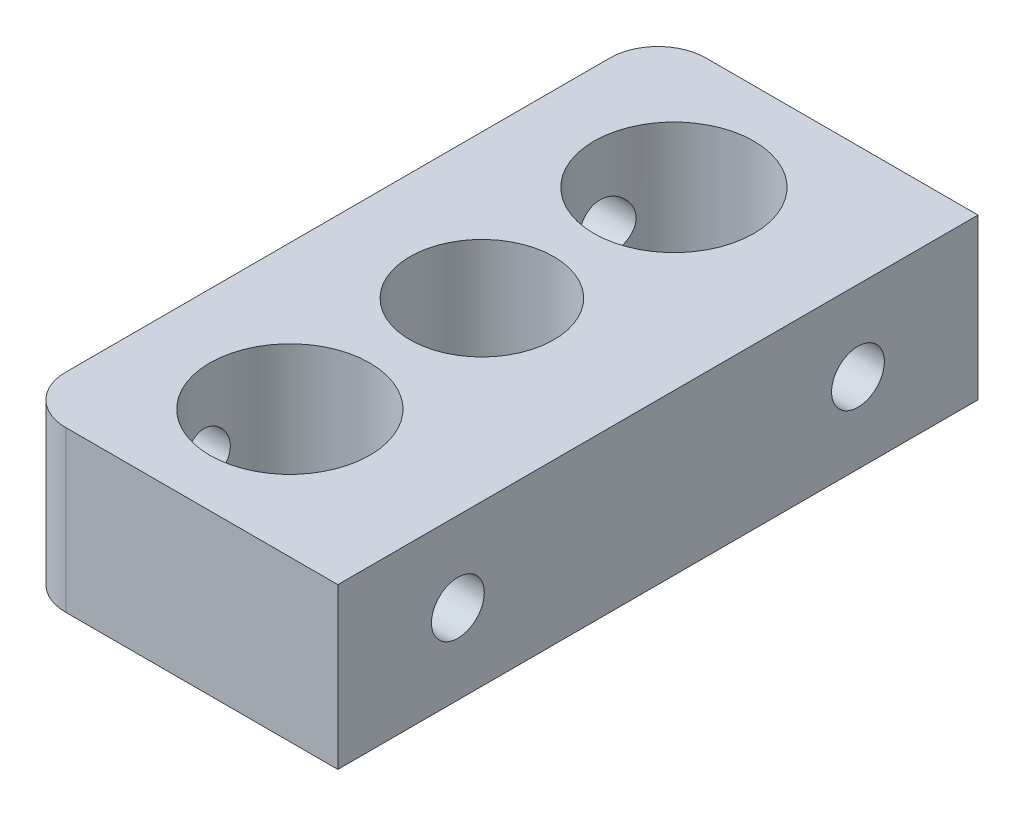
ISO-10303-21;
HEADER;
FILE_DESCRIPTION(('STEP AP214'),'2;1');
FILE_NAME('part.step','',(''),(''),'','','');
FILE_SCHEMA(('AUTOMOTIVE_DESIGN { 1 0 10303 214 1 1 1 1 }'));
ENDSEC;
DATA;
#1=APPLICATION_CONTEXT('core data for automotive mechanical design processes');
#2=APPLICATION_PROTOCOL_DEFINITION('international standard','automotive_design',2000,#1);
#3=PRODUCT_CONTEXT('',#1,'mechanical');
#4=PRODUCT('Part','Part','',(#3));
#5=PRODUCT_RELATED_PRODUCT_CATEGORY('part','',(#4));
#6=PRODUCT_DEFINITION_FORMATION('','',#4);
#7=PRODUCT_DEFINITION_CONTEXT('part definition',#1,'design');
#8=PRODUCT_DEFINITION('design','',#6,#7);
#9=PRODUCT_DEFINITION_SHAPE('','',#8);
#10=(LENGTH_UNIT() NAMED_UNIT(*) SI_UNIT(.MILLI.,.METRE.));
#11=(NAMED_UNIT(*) PLANE_ANGLE_UNIT() SI_UNIT($,.RADIAN.));
#12=(NAMED_UNIT(*) SI_UNIT($,.STERADIAN.) SOLID_ANGLE_UNIT());
#13=UNCERTAINTY_MEASURE_WITH_UNIT(LENGTH_MEASURE(1.E-05),#10,'distance_accuracy_value','');
#14=(GEOMETRIC_REPRESENTATION_CONTEXT(3) GLOBAL_UNCERTAINTY_ASSIGNED_CONTEXT((#13)) GLOBAL_UNIT_ASSIGNED_CONTEXT((#10,
#11,#12)) REPRESENTATION_CONTEXT('',''));
#15=CARTESIAN_POINT('',(0.,0.,0.));
#16=DIRECTION('',(0.,0.,1.));
#17=DIRECTION('',(1.,0.,0.));
#18=AXIS2_PLACEMENT_3D('',#15,#16,#17);
#19=CARTESIAN_POINT('',(-9.,-5.,-40.));
#20=DIRECTION('',(1.,0.,0.));
#21=DIRECTION('',(0.,0.,-1.));
#22=AXIS2_PLACEMENT_3D('',#19,#20,#21);
#23=PLANE('',#22);
#24=CARTESIAN_POINT('',(-9.,0.,-32.5));
#25=DIRECTION('',(1.,0.,0.));
#26=DIRECTION('',(0.,0.,-1.));
#27=AXIS2_PLACEMENT_3D('',#24,#25,#26);
#28=CIRCLE('',#27,1.65);
#29=CARTESIAN_POINT('',(-9.,0.,-34.15));
#30=VERTEX_POINT('',#29);
#31=EDGE_CURVE('E218',#30,#30,#28,.T.);
#32=ORIENTED_EDGE('',*,*,#31,.F.);
#33=EDGE_LOOP('',(#32));
#34=FACE_BOUND('',#33,.T.);
#35=CARTESIAN_POINT('',(-9.,0.,-7.5));
#36=DIRECTION('',(1.,0.,0.));
#37=DIRECTION('',(0.,0.,-1.));
#38=AXIS2_PLACEMENT_3D('',#35,#36,#37);
#39=CIRCLE('',#38,1.65);
#40=CARTESIAN_POINT('',(-9.,0.,-9.15));
#41=VERTEX_POINT('',#40);
#42=EDGE_CURVE('E150',#41,#41,#39,.T.);
#43=ORIENTED_EDGE('',*,*,#42,.F.);
#44=EDGE_LOOP('',(#43));
#45=FACE_BOUND('',#44,.T.);
#46=DIRECTION('',(0.,1.,0.));
#47=VECTOR('',#46,1.);
#48=CARTESIAN_POINT('',(-9.,-5.,0.));
#49=LINE('',#48,#47);
#50=CARTESIAN_POINT('',(-9.,-5.,0.));
#51=VERTEX_POINT('',#50);
#52=CARTESIAN_POINT('',(-9.,5.,0.));
#53=VERTEX_POINT('',#52);
#54=EDGE_CURVE('E97',#51,#53,#49,.T.);
#55=ORIENTED_EDGE('',*,*,#54,.F.);
#56=DIRECTION('',(0.,0.,1.));
#57=VECTOR('',#56,1.);
#58=CARTESIAN_POINT('',(-9.,-5.,-40.));
#59=LINE('',#58,#57);
#60=CARTESIAN_POINT('',(-9.,-5.,-40.));
#61=VERTEX_POINT('',#60);
#62=EDGE_CURVE('E88',#61,#51,#59,.T.);
#63=ORIENTED_EDGE('',*,*,#62,.F.);
#64=DIRECTION('',(0.,1.,0.));
#65=VECTOR('',#64,1.);
#66=CARTESIAN_POINT('',(-9.,-5.,-40.));
#67=LINE('',#66,#65);
#68=CARTESIAN_POINT('',(-9.,5.,-40.));
#69=VERTEX_POINT('',#68);
#70=EDGE_CURVE('E84',#61,#69,#67,.T.);
#71=ORIENTED_EDGE('',*,*,#70,.T.);
#72=DIRECTION('',(0.,0.,1.));
#73=VECTOR('',#72,1.);
#74=CARTESIAN_POINT('',(-9.,5.,-40.));
#75=LINE('',#74,#73);
#76=EDGE_CURVE('E70',#69,#53,#75,.T.);
#77=ORIENTED_EDGE('',*,*,#76,.T.);
#78=EDGE_LOOP('',(#55,#63,#71,#77));
#79=FACE_BOUND('',#78,.T.);
#80=ADVANCED_FACE('F16',(#34,#45,#79),#23,.T.);
#81=CARTESIAN_POINT('',(-9.,-5.,-40.));
#82=DIRECTION('',(0.,-1.,0.));
#83=DIRECTION('',(1.,0.,0.));
#84=AXIS2_PLACEMENT_3D('',#81,#82,#83);
#85=PLANE('',#84);
#86=CARTESIAN_POINT('',(-20.0000000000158,-5.,-19.999999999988));
#87=DIRECTION('',(0.,-1.,0.));
#88=DIRECTION('',(0.,0.,-1.));
#89=AXIS2_PLACEMENT_3D('',#86,#87,#88);
#90=CIRCLE('',#89,4.5);
#91=CARTESIAN_POINT('',(-20.0000000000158,-5.,-24.499999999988));
#92=VERTEX_POINT('',#91);
#93=EDGE_CURVE('E216',#92,#92,#90,.T.);
#94=ORIENTED_EDGE('',*,*,#93,.F.);
#95=EDGE_LOOP('',(#94));
#96=FACE_BOUND('',#95,.T.);
#97=CARTESIAN_POINT('',(-20.,-5.,-8.));
#98=DIRECTION('',(0.,1.,0.));
#99=DIRECTION('',(0.,0.,1.));
#100=AXIS2_PLACEMENT_3D('',#97,#98,#99);
#101=CIRCLE('',#100,5.);
#102=CARTESIAN_POINT('',(-20.,-5.,-3.));
#103=VERTEX_POINT('',#102);
#104=EDGE_CURVE('E233',#103,#103,#101,.T.);
#105=ORIENTED_EDGE('',*,*,#104,.T.);
#106=EDGE_LOOP('',(#105));
#107=FACE_BOUND('',#106,.T.);
#108=CARTESIAN_POINT('',(-20.,-5.,-32.));
#109=DIRECTION('',(0.,1.,0.));
#110=DIRECTION('',(0.,0.,1.));
#111=AXIS2_PLACEMENT_3D('',#108,#109,#110);
#112=CIRCLE('',#111,5.);
#113=CARTESIAN_POINT('',(-20.,-5.,-27.));
#114=VERTEX_POINT('',#113);
#115=EDGE_CURVE('E93',#114,#114,#112,.T.);
#116=ORIENTED_EDGE('',*,*,#115,.T.);
#117=EDGE_LOOP('',(#116));
#118=FACE_BOUND('',#117,.T.);
#119=DIRECTION('',(0.,0.,1.));
#120=VECTOR('',#119,1.);
#121=CARTESIAN_POINT('',(-29.,-5.,-40.));
#122=LINE('',#121,#120);
#123=CARTESIAN_POINT('',(-29.,-5.,-37.));
#124=VERTEX_POINT('',#123);
#125=CARTESIAN_POINT('',(-29.,-5.,-3.));
#126=VERTEX_POINT('',#125);
#127=EDGE_CURVE('E102',#124,#126,#122,.T.);
#128=ORIENTED_EDGE('',*,*,#127,.F.);
#129=CARTESIAN_POINT('',(-26.,-5.,-37.));
#130=DIRECTION('',(0.,-1.,0.));
#131=DIRECTION('',(1.,0.,0.));
#132=AXIS2_PLACEMENT_3D('',#129,#130,#131);
#133=CIRCLE('',#132,3.);
#134=CARTESIAN_POINT('',(-26.,-5.,-40.));
#135=VERTEX_POINT('',#134);
#136=EDGE_CURVE('E193',#124,#135,#133,.T.);
#137=ORIENTED_EDGE('',*,*,#136,.T.);
#138=DIRECTION('',(1.,0.,0.));
#139=VECTOR('',#138,1.);
#140=CARTESIAN_POINT('',(-9.,-5.,-40.));
#141=LINE('',#140,#139);
#142=EDGE_CURVE('E80',#135,#61,#141,.T.);
#143=ORIENTED_EDGE('',*,*,#142,.T.);
#144=ORIENTED_EDGE('',*,*,#62,.T.);
#145=DIRECTION('',(1.,0.,0.));
#146=VECTOR('',#145,1.);
#147=CARTESIAN_POINT('',(-9.,-5.,0.));
#148=LINE('',#147,#146);
#149=CARTESIAN_POINT('',(-26.,-5.,0.));
#150=VERTEX_POINT('',#149);
#151=EDGE_CURVE('E89',#150,#51,#148,.T.);
#152=ORIENTED_EDGE('',*,*,#151,.F.);
#153=CARTESIAN_POINT('',(-26.,-5.,-3.));
#154=DIRECTION('',(0.,-1.,0.));
#155=DIRECTION('',(1.,0.,0.));
#156=AXIS2_PLACEMENT_3D('',#153,#154,#155);
#157=CIRCLE('',#156,3.);
#158=EDGE_CURVE('E195',#150,#126,#157,.T.);
#159=ORIENTED_EDGE('',*,*,#158,.T.);
#160=EDGE_LOOP('',(#128,#137,#143,#144,#152,#159));
#161=FACE_BOUND('',#160,.T.);
#162=ADVANCED_FACE('F164',(#96,#107,#118,#161),#85,.T.);
#163=CARTESIAN_POINT('',(-29.,-5.,-40.));
#164=DIRECTION('',(-1.,0.,0.));
#165=DIRECTION('',(0.,0.,1.));
#166=AXIS2_PLACEMENT_3D('',#163,#164,#165);
#167=PLANE('',#166);
#168=CARTESIAN_POINT('',(-29.,0.,-32.5));
#169=DIRECTION('',(1.,0.,0.));
#170=DIRECTION('',(0.,0.,-1.));
#171=AXIS2_PLACEMENT_3D('',#168,#169,#170);
#172=CIRCLE('',#171,1.65);
#173=CARTESIAN_POINT('',(-29.,0.,-34.15));
#174=VERTEX_POINT('',#173);
#175=EDGE_CURVE('E223',#174,#174,#172,.T.);
#176=ORIENTED_EDGE('',*,*,#175,.T.);
#177=EDGE_LOOP('',(#176));
#178=FACE_BOUND('',#177,.T.);
#179=CARTESIAN_POINT('',(-29.,0.,-7.5));
#180=DIRECTION('',(1.,0.,0.));
#181=DIRECTION('',(0.,0.,-1.));
#182=AXIS2_PLACEMENT_3D('',#179,#180,#181);
#183=CIRCLE('',#182,1.65);
#184=CARTESIAN_POINT('',(-29.,0.,-9.15));
#185=VERTEX_POINT('',#184);
#186=EDGE_CURVE('E115',#185,#185,#183,.T.);
#187=ORIENTED_EDGE('',*,*,#186,.T.);
#188=EDGE_LOOP('',(#187));
#189=FACE_BOUND('',#188,.T.);
#190=DIRECTION('',(0.,0.,1.));
#191=VECTOR('',#190,1.);
#192=CARTESIAN_POINT('',(-29.,5.,-40.));
#193=LINE('',#192,#191);
#194=CARTESIAN_POINT('',(-29.,5.,-37.));
#195=VERTEX_POINT('',#194);
#196=CARTESIAN_POINT('',(-29.,5.,-3.));
#197=VERTEX_POINT('',#196);
#198=EDGE_CURVE('E79',#195,#197,#193,.T.);
#199=ORIENTED_EDGE('',*,*,#198,.F.);
#200=DIRECTION('',(0.,-1.,0.));
#201=VECTOR('',#200,1.);
#202=CARTESIAN_POINT('',(-29.,-5.,-37.));
#203=LINE('',#202,#201);
#204=EDGE_CURVE('E188',#195,#124,#203,.T.);
#205=ORIENTED_EDGE('',*,*,#204,.T.);
#206=ORIENTED_EDGE('',*,*,#127,.T.);
#207=DIRECTION('',(0.,-1.,0.));
#208=VECTOR('',#207,1.);
#209=CARTESIAN_POINT('',(-29.,-5.,-3.));
#210=LINE('',#209,#208);
#211=EDGE_CURVE('E101',#126,#197,#210,.F.);
#212=ORIENTED_EDGE('',*,*,#211,.T.);
#213=EDGE_LOOP('',(#199,#205,#206,#212));
#214=FACE_BOUND('',#213,.T.);
#215=ADVANCED_FACE('F167',(#178,#189,#214),#167,.T.);
#216=CARTESIAN_POINT('',(-9.,5.,-40.));
#217=DIRECTION('',(0.,1.,0.));
#218=DIRECTION('',(-1.,0.,0.));
#219=AXIS2_PLACEMENT_3D('',#216,#217,#218);
#220=PLANE('',#219);
#221=CARTESIAN_POINT('',(-20.0000000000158,5.,-19.999999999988));
#222=DIRECTION('',(0.,-1.,0.));
#223=DIRECTION('',(0.,0.,-1.));
#224=AXIS2_PLACEMENT_3D('',#221,#222,#223);
#225=CIRCLE('',#224,4.5);
#226=CARTESIAN_POINT('',(-20.0000000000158,5.,-24.499999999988));
#227=VERTEX_POINT('',#226);
#228=EDGE_CURVE('E213',#227,#227,#225,.T.);
#229=ORIENTED_EDGE('',*,*,#228,.T.);
#230=EDGE_LOOP('',(#229));
#231=FACE_BOUND('',#230,.T.);
#232=CARTESIAN_POINT('',(-20.,5.,-8.));
#233=DIRECTION('',(0.,1.,0.));
#234=DIRECTION('',(0.,0.,1.));
#235=AXIS2_PLACEMENT_3D('',#232,#233,#234);
#236=CIRCLE('',#235,5.);
#237=CARTESIAN_POINT('',(-20.,5.,-3.));
#238=VERTEX_POINT('',#237);
#239=EDGE_CURVE('E230',#238,#238,#236,.T.);
#240=ORIENTED_EDGE('',*,*,#239,.F.);
#241=EDGE_LOOP('',(#240));
#242=FACE_BOUND('',#241,.T.);
#243=CARTESIAN_POINT('',(-20.,5.,-32.));
#244=DIRECTION('',(0.,1.,0.));
#245=DIRECTION('',(0.,0.,1.));
#246=AXIS2_PLACEMENT_3D('',#243,#244,#245);
#247=CIRCLE('',#246,5.);
#248=CARTESIAN_POINT('',(-20.,5.,-27.));
#249=VERTEX_POINT('',#248);
#250=EDGE_CURVE('E235',#249,#249,#247,.T.);
#251=ORIENTED_EDGE('',*,*,#250,.F.);
#252=EDGE_LOOP('',(#251));
#253=FACE_BOUND('',#252,.T.);
#254=DIRECTION('',(-1.,0.,0.));
#255=VECTOR('',#254,1.);
#256=CARTESIAN_POINT('',(-9.,5.,-40.));
#257=LINE('',#256,#255);
#258=CARTESIAN_POINT('',(-26.,5.,-40.));
#259=VERTEX_POINT('',#258);
#260=EDGE_CURVE('E72',#69,#259,#257,.T.);
#261=ORIENTED_EDGE('',*,*,#260,.T.);
#262=CARTESIAN_POINT('',(-26.,5.,-37.));
#263=DIRECTION('',(0.,1.,0.));
#264=DIRECTION('',(-1.,0.,0.));
#265=AXIS2_PLACEMENT_3D('',#262,#263,#264);
#266=CIRCLE('',#265,3.);
#267=EDGE_CURVE('E24',#259,#195,#266,.T.);
#268=ORIENTED_EDGE('',*,*,#267,.T.);
#269=ORIENTED_EDGE('',*,*,#198,.T.);
#270=CARTESIAN_POINT('',(-26.,5.,-3.));
#271=DIRECTION('',(0.,1.,0.));
#272=DIRECTION('',(-1.,0.,0.));
#273=AXIS2_PLACEMENT_3D('',#270,#271,#272);
#274=CIRCLE('',#273,3.);
#275=CARTESIAN_POINT('',(-26.,5.,0.));
#276=VERTEX_POINT('',#275);
#277=EDGE_CURVE('E31',#197,#276,#274,.T.);
#278=ORIENTED_EDGE('',*,*,#277,.T.);
#279=DIRECTION('',(-1.,0.,0.));
#280=VECTOR('',#279,1.);
#281=CARTESIAN_POINT('',(-9.,5.,0.));
#282=LINE('',#281,#280);
#283=EDGE_CURVE('E74',#53,#276,#282,.T.);
#284=ORIENTED_EDGE('',*,*,#283,.F.);
#285=ORIENTED_EDGE('',*,*,#76,.F.);
#286=EDGE_LOOP('',(#261,#268,#269,#278,#284,#285));
#287=FACE_BOUND('',#286,.T.);
#288=ADVANCED_FACE('F71',(#231,#242,#253,#287),#220,.T.);
#289=CARTESIAN_POINT('',(0.,0.,-40.));
#290=DIRECTION('',(0.,0.,1.));
#291=DIRECTION('',(1.,0.,0.));
#292=AXIS2_PLACEMENT_3D('',#289,#290,#291);
#293=PLANE('',#292);
#294=ORIENTED_EDGE('',*,*,#142,.F.);
#295=DIRECTION('',(0.,-1.,0.));
#296=VECTOR('',#295,1.);
#297=CARTESIAN_POINT('',(-26.,5.,-40.));
#298=LINE('',#297,#296);
#299=EDGE_CURVE('E39',#135,#259,#298,.F.);
#300=ORIENTED_EDGE('',*,*,#299,.T.);
#301=ORIENTED_EDGE('',*,*,#260,.F.);
#302=ORIENTED_EDGE('',*,*,#70,.F.);
#303=EDGE_LOOP('',(#294,#300,#301,#302));
#304=FACE_BOUND('',#303,.T.);
#305=ADVANCED_FACE('F83',(#304),#293,.F.);
#306=CARTESIAN_POINT('',(0.,0.,0.));
#307=DIRECTION('',(0.,0.,1.));
#308=DIRECTION('',(1.,0.,0.));
#309=AXIS2_PLACEMENT_3D('',#306,#307,#308);
#310=PLANE('',#309);
#311=ORIENTED_EDGE('',*,*,#283,.T.);
#312=DIRECTION('',(0.,-1.,0.));
#313=VECTOR('',#312,1.);
#314=CARTESIAN_POINT('',(-26.,0.,0.));
#315=LINE('',#314,#313);
#316=EDGE_CURVE('E11',#276,#150,#315,.T.);
#317=ORIENTED_EDGE('',*,*,#316,.T.);
#318=ORIENTED_EDGE('',*,*,#151,.T.);
#319=ORIENTED_EDGE('',*,*,#54,.T.);
#320=EDGE_LOOP('',(#311,#317,#318,#319));
#321=FACE_BOUND('',#320,.T.);
#322=ADVANCED_FACE('F156',(#321),#310,.T.);
#323=CARTESIAN_POINT('',(-20.,5.,-32.));
#324=DIRECTION('',(0.,1.,0.));
#325=DIRECTION('',(0.,0.,1.));
#326=AXIS2_PLACEMENT_3D('',#323,#324,#325);
#327=CYLINDRICAL_SURFACE('',#326,5.);
#328=CARTESIAN_POINT('',(-24.5141444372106,0.,-34.15));
#329=CARTESIAN_POINT('',(-24.5141439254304,-0.0875265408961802,-34.1500006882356));
#330=CARTESIAN_POINT('',(-24.5174949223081,-0.175049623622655,-34.143007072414));
#331=CARTESIAN_POINT('',(-24.5305012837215,-0.347431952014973,-34.1153687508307));
#332=CARTESIAN_POINT('',(-24.5401584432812,-0.432290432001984,-34.0947201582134));
#333=CARTESIAN_POINT('',(-24.5646747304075,-0.596739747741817,-34.0407378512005));
#334=CARTESIAN_POINT('',(-24.5795177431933,-0.676346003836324,-34.007443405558));
#335=CARTESIAN_POINT('',(-24.6129762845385,-0.828798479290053,-33.9293133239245));
#336=CARTESIAN_POINT('',(-24.6315928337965,-0.901642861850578,-33.8844745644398));
#337=CARTESIAN_POINT('',(-24.6721528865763,-1.04307012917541,-33.7816301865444));
#338=CARTESIAN_POINT('',(-24.6942250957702,-1.11117804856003,-33.7230227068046));
#339=CARTESIAN_POINT('',(-24.7390241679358,-1.23692827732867,-33.5956831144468));
#340=CARTESIAN_POINT('',(-24.7617512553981,-1.29456694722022,-33.526947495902));
#341=CARTESIAN_POINT('',(-24.8075930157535,-1.40143945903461,-33.3760979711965));
#342=CARTESIAN_POINT('',(-24.8306384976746,-1.44989364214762,-33.2934077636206));
#343=CARTESIAN_POINT('',(-24.8737074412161,-1.53198747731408,-33.1202346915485));
#344=CARTESIAN_POINT('',(-24.8937312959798,-1.56562905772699,-33.0297528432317));
#345=CARTESIAN_POINT('',(-24.9288538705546,-1.61616597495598,-32.8455672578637));
#346=CARTESIAN_POINT('',(-24.9440536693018,-1.63342258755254,-32.7519825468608));
#347=CARTESIAN_POINT('',(-24.9691698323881,-1.6515535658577,-32.5625515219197));
#348=CARTESIAN_POINT('',(-24.9790885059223,-1.65243509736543,-32.4667062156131));
#349=CARTESIAN_POINT('',(-24.9928724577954,-1.63796061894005,-32.2816425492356));
#350=CARTESIAN_POINT('',(-24.9970650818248,-1.62357518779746,-32.192371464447));
#351=CARTESIAN_POINT('',(-25.0007366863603,-1.58038674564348,-32.0172944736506));
#352=CARTESIAN_POINT('',(-25.0002160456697,-1.55158489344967,-31.931488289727));
#353=CARTESIAN_POINT('',(-24.9952463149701,-1.48104219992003,-31.7672910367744));
#354=CARTESIAN_POINT('',(-24.9908658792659,-1.43953571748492,-31.688796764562));
#355=CARTESIAN_POINT('',(-24.9793217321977,-1.34460702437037,-31.5396081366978));
#356=CARTESIAN_POINT('',(-24.9721575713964,-1.29118289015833,-31.4689150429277));
#357=CARTESIAN_POINT('',(-24.9560578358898,-1.17201775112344,-31.3350316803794));
#358=CARTESIAN_POINT('',(-24.9470744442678,-1.10594770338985,-31.2721400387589));
#359=CARTESIAN_POINT('',(-24.9289464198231,-0.964372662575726,-31.1580791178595));
#360=CARTESIAN_POINT('',(-24.9198017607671,-0.888866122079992,-31.1069117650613));
#361=CARTESIAN_POINT('',(-24.9025496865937,-0.728386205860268,-31.0165452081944));
#362=CARTESIAN_POINT('',(-24.8944733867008,-0.643225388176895,-30.9776720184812));
#363=CARTESIAN_POINT('',(-24.8809264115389,-0.467378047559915,-30.9148273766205));
#364=CARTESIAN_POINT('',(-24.875455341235,-0.376692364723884,-30.8908536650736));
#365=CARTESIAN_POINT('',(-24.868061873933,-0.193851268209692,-30.8588414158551));
#366=CARTESIAN_POINT('',(-24.8660859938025,-0.101740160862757,-30.8505625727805));
#367=CARTESIAN_POINT('',(-24.8658334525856,0.0825707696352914,-30.8494931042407));
#368=CARTESIAN_POINT('',(-24.8675564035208,0.174770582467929,-30.8567008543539));
#369=CARTESIAN_POINT('',(-24.8743593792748,0.354823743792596,-30.8860713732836));
#370=CARTESIAN_POINT('',(-24.8793754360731,0.442726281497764,-30.9079493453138));
#371=CARTESIAN_POINT('',(-24.8919391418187,0.613619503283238,-30.9656895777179));
#372=CARTESIAN_POINT('',(-24.8994871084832,0.696609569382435,-31.001553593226));
#373=CARTESIAN_POINT('',(-24.9161181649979,0.856798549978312,-31.0869304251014));
#374=CARTESIAN_POINT('',(-24.9252238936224,0.933883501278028,-31.1366525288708));
#375=CARTESIAN_POINT('',(-24.9434727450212,1.07877663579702,-31.2481612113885));
#376=CARTESIAN_POINT('',(-24.9526158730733,1.14658345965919,-31.3099495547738));
#377=CARTESIAN_POINT('',(-24.9696116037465,1.27232109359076,-31.4453001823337));
#378=CARTESIAN_POINT('',(-24.9774361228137,1.3300377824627,-31.5190653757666));
#379=CARTESIAN_POINT('',(-24.9900728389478,1.43226483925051,-31.6754750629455));
#380=CARTESIAN_POINT('',(-24.9948855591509,1.47677749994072,-31.7581180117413));
#381=CARTESIAN_POINT('',(-25.0001910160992,1.55043720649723,-31.9281183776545));
#382=CARTESIAN_POINT('',(-25.0007701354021,1.57988003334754,-32.0153447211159));
#383=CARTESIAN_POINT('',(-24.9970515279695,1.62384720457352,-32.1933703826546));
#384=CARTESIAN_POINT('',(-24.9927549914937,1.63837518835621,-32.2841688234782));
#385=CARTESIAN_POINT('',(-24.9792536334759,1.65196712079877,-32.4635293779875));
#386=CARTESIAN_POINT('',(-24.970214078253,1.65152168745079,-32.5520674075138));
#387=CARTESIAN_POINT('',(-24.9476018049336,1.63662698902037,-32.7273575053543));
#388=CARTESIAN_POINT('',(-24.9340288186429,1.62217689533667,-32.8141094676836));
#389=CARTESIAN_POINT('',(-24.9028746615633,1.57970931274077,-32.9845931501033));
#390=CARTESIAN_POINT('',(-24.8852473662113,1.55153116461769,-33.0682761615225));
#391=CARTESIAN_POINT('',(-24.8471683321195,1.48254238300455,-33.2295673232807));
#392=CARTESIAN_POINT('',(-24.8267157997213,1.4417281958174,-33.3071737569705));
#393=CARTESIAN_POINT('',(-24.7831100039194,1.34591281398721,-33.4589187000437));
#394=CARTESIAN_POINT('',(-24.7598691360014,1.29023259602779,-33.5326035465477));
#395=CARTESIAN_POINT('',(-24.713515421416,1.16734671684,-33.6697370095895));
#396=CARTESIAN_POINT('',(-24.6904026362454,1.10013594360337,-33.7331810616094));
#397=CARTESIAN_POINT('',(-24.6454388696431,0.952937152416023,-33.8504021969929));
#398=CARTESIAN_POINT('',(-24.6236668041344,0.872566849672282,-33.9037319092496));
#399=CARTESIAN_POINT('',(-24.5846381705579,0.702914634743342,-33.9958987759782));
#400=CARTESIAN_POINT('',(-24.5673786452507,0.61363861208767,-34.0347454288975));
#401=CARTESIAN_POINT('',(-24.5408328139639,0.437848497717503,-34.0932678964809));
#402=CARTESIAN_POINT('',(-24.5309272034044,0.351933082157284,-34.1144586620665));
#403=CARTESIAN_POINT('',(-24.5175850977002,0.177342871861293,-34.1428204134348));
#404=CARTESIAN_POINT('',(-24.5141449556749,0.0886696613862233,-34.1499993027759));
#405=CARTESIAN_POINT('',(-24.5141444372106,0.,-34.15));
#406=B_SPLINE_CURVE_WITH_KNOTS('',3,(#328,#329,#330,#331,#332,#333,#334,#335,#336,#337,#338,
#339,#340,#341,#342,#343,#344,#345,#346,#347,#348,#349,#350,#351,#352,#353,#354,#355,#356,#357,
#358,#359,#360,#361,#362,#363,#364,#365,#366,#367,#368,#369,#370,#371,#372,#373,#374,#375,#376,
#377,#378,#379,#380,#381,#382,#383,#384,#385,#386,#387,#388,#389,#390,#391,#392,#393,#394,#395,
#396,#397,#398,#399,#400,#401,#402,#403,#404,#405),.UNSPECIFIED.,.T.,.F.,(4,2,2,2,2,2,2,2,2,2,2,
2,2,2,2,2,2,2,2,2,2,2,2,2,2,2,2,2,2,2,2,2,2,2,2,2,2,2,4),(0.,0.262241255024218,
0.524557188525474,0.786065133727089,1.04764390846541,1.32403647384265,1.60052494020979,
1.89480772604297,2.18905218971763,2.47664685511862,2.76411566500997,3.03434525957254,
3.30455313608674,3.57004969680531,3.83558914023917,4.10931789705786,4.38309159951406,
4.66361210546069,4.94409006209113,5.22023778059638,5.49635653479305,5.76726440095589,
6.0382062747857,6.31348512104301,6.58880425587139,6.86939860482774,7.14994420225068,
7.42474913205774,7.69948699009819,7.96523185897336,8.23099245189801,8.49994079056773,
8.76896483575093,9.05340714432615,9.33797588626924,9.63312986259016,9.92808992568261,
10.1939061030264,10.4595723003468),.UNSPECIFIED.);
#407=CARTESIAN_POINT('',(-24.5141444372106,0.,-34.15));
#408=VERTEX_POINT('',#407);
#409=EDGE_CURVE('E144',#408,#408,#406,.T.);
#410=ORIENTED_EDGE('',*,*,#409,.T.);
#411=EDGE_LOOP('',(#410));
#412=FACE_BOUND('',#411,.T.);
#413=CARTESIAN_POINT('',(-15.4858555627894,0.,-34.15));
#414=CARTESIAN_POINT('',(-15.4858560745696,0.0875265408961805,-34.1500006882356));
#415=CARTESIAN_POINT('',(-15.4825050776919,0.175049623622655,-34.143007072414));
#416=CARTESIAN_POINT('',(-15.4694987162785,0.347431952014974,-34.1153687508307));
#417=CARTESIAN_POINT('',(-15.4598415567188,0.432290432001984,-34.0947201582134));
#418=CARTESIAN_POINT('',(-15.4353252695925,0.59673974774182,-34.0407378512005));
#419=CARTESIAN_POINT('',(-15.4204822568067,0.676346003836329,-34.007443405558));
#420=CARTESIAN_POINT('',(-15.3870237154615,0.828798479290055,-33.9293133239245));
#421=CARTESIAN_POINT('',(-15.3684071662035,0.901642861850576,-33.8844745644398));
#422=CARTESIAN_POINT('',(-15.3278471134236,1.04307012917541,-33.7816301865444));
#423=CARTESIAN_POINT('',(-15.3057749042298,1.11117804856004,-33.7230227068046));
#424=CARTESIAN_POINT('',(-15.2609758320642,1.23692827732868,-33.5956831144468));
#425=CARTESIAN_POINT('',(-15.2382487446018,1.29456694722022,-33.526947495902));
#426=CARTESIAN_POINT('',(-15.1924069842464,1.4014394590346,-33.3760979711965));
#427=CARTESIAN_POINT('',(-15.1693615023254,1.44989364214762,-33.2934077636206));
#428=CARTESIAN_POINT('',(-15.126292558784,1.53198747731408,-33.1202346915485));
#429=CARTESIAN_POINT('',(-15.1062687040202,1.56562905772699,-33.0297528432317));
#430=CARTESIAN_POINT('',(-15.0711461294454,1.61616597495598,-32.8455672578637));
#431=CARTESIAN_POINT('',(-15.0559463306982,1.63342258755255,-32.7519825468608));
#432=CARTESIAN_POINT('',(-15.0308301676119,1.6515535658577,-32.5625515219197));
#433=CARTESIAN_POINT('',(-15.0209114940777,1.65243509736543,-32.4667062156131));
#434=CARTESIAN_POINT('',(-15.0071275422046,1.63796061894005,-32.2816425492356));
#435=CARTESIAN_POINT('',(-15.0029349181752,1.62357518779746,-32.192371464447));
#436=CARTESIAN_POINT('',(-14.9992633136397,1.58038674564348,-32.0172944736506));
#437=CARTESIAN_POINT('',(-14.9997839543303,1.55158489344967,-31.931488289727));
#438=CARTESIAN_POINT('',(-15.0047536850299,1.48104219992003,-31.7672910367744));
#439=CARTESIAN_POINT('',(-15.0091341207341,1.43953571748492,-31.688796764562));
#440=CARTESIAN_POINT('',(-15.0206782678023,1.34460702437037,-31.5396081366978));
#441=CARTESIAN_POINT('',(-15.0278424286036,1.29118289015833,-31.4689150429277));
#442=CARTESIAN_POINT('',(-15.0439421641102,1.17201775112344,-31.3350316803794));
#443=CARTESIAN_POINT('',(-15.0529255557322,1.10594770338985,-31.2721400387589));
#444=CARTESIAN_POINT('',(-15.0710535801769,0.964372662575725,-31.1580791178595));
#445=CARTESIAN_POINT('',(-15.0801982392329,0.888866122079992,-31.1069117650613));
#446=CARTESIAN_POINT('',(-15.0974503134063,0.728386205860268,-31.0165452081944));
#447=CARTESIAN_POINT('',(-15.1055266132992,0.643225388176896,-30.9776720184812));
#448=CARTESIAN_POINT('',(-15.1190735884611,0.467378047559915,-30.9148273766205));
#449=CARTESIAN_POINT('',(-15.124544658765,0.376692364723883,-30.8908536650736));
#450=CARTESIAN_POINT('',(-15.131938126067,0.193851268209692,-30.8588414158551));
#451=CARTESIAN_POINT('',(-15.1339140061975,0.101740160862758,-30.8505625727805));
#452=CARTESIAN_POINT('',(-15.1341665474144,-0.082570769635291,-30.8494931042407));
#453=CARTESIAN_POINT('',(-15.1324435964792,-0.174770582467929,-30.8567008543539));
#454=CARTESIAN_POINT('',(-15.1256406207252,-0.354823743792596,-30.8860713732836));
#455=CARTESIAN_POINT('',(-15.1206245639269,-0.442726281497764,-30.9079493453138));
#456=CARTESIAN_POINT('',(-15.1080608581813,-0.613619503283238,-30.9656895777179));
#457=CARTESIAN_POINT('',(-15.1005128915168,-0.696609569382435,-31.001553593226));
#458=CARTESIAN_POINT('',(-15.0838818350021,-0.856798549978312,-31.0869304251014));
#459=CARTESIAN_POINT('',(-15.0747761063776,-0.933883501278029,-31.1366525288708));
#460=CARTESIAN_POINT('',(-15.0565272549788,-1.07877663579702,-31.2481612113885));
#461=CARTESIAN_POINT('',(-15.0473841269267,-1.14658345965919,-31.3099495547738));
#462=CARTESIAN_POINT('',(-15.0303883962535,-1.27232109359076,-31.4453001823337));
#463=CARTESIAN_POINT('',(-15.0225638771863,-1.3300377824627,-31.5190653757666));
#464=CARTESIAN_POINT('',(-15.0099271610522,-1.43226483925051,-31.6754750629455));
#465=CARTESIAN_POINT('',(-15.0051144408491,-1.47677749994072,-31.7581180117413));
#466=CARTESIAN_POINT('',(-14.9998089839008,-1.55043720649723,-31.9281183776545));
#467=CARTESIAN_POINT('',(-14.9992298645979,-1.57988003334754,-32.0153447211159));
#468=CARTESIAN_POINT('',(-15.0029484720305,-1.62384720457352,-32.1933703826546));
#469=CARTESIAN_POINT('',(-15.0072450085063,-1.63837518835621,-32.2841688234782));
#470=CARTESIAN_POINT('',(-15.0207463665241,-1.65196712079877,-32.4635293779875));
#471=CARTESIAN_POINT('',(-15.0297859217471,-1.65152168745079,-32.5520674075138));
#472=CARTESIAN_POINT('',(-15.0523981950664,-1.63662698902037,-32.7273575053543));
#473=CARTESIAN_POINT('',(-15.065971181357,-1.62217689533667,-32.8141094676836));
#474=CARTESIAN_POINT('',(-15.0971253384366,-1.57970931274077,-32.9845931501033));
#475=CARTESIAN_POINT('',(-15.1147526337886,-1.55153116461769,-33.0682761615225));
#476=CARTESIAN_POINT('',(-15.1528316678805,-1.48254238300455,-33.2295673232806));
#477=CARTESIAN_POINT('',(-15.1732842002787,-1.4417281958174,-33.3071737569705));
#478=CARTESIAN_POINT('',(-15.2168899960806,-1.34591281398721,-33.4589187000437));
#479=CARTESIAN_POINT('',(-15.2401308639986,-1.29023259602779,-33.5326035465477));
#480=CARTESIAN_POINT('',(-15.286484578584,-1.16734671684,-33.6697370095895));
#481=CARTESIAN_POINT('',(-15.3095973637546,-1.10013594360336,-33.7331810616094));
#482=CARTESIAN_POINT('',(-15.3545611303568,-0.95293715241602,-33.8504021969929));
#483=CARTESIAN_POINT('',(-15.3763331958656,-0.872566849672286,-33.9037319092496));
#484=CARTESIAN_POINT('',(-15.4153618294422,-0.702914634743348,-33.9958987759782));
#485=CARTESIAN_POINT('',(-15.4326213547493,-0.613638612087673,-34.0347454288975));
#486=CARTESIAN_POINT('',(-15.4591671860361,-0.437848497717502,-34.0932678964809));
#487=CARTESIAN_POINT('',(-15.4690727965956,-0.351933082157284,-34.1144586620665));
#488=CARTESIAN_POINT('',(-15.4824149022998,-0.177342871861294,-34.1428204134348));
#489=CARTESIAN_POINT('',(-15.4858550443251,-0.0886696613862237,-34.1499993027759));
#490=CARTESIAN_POINT('',(-15.4858555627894,0.,-34.15));
#491=B_SPLINE_CURVE_WITH_KNOTS('',3,(#413,#414,#415,#416,#417,#418,#419,#420,#421,#422,#423,
#424,#425,#426,#427,#428,#429,#430,#431,#432,#433,#434,#435,#436,#437,#438,#439,#440,#441,#442,
#443,#444,#445,#446,#447,#448,#449,#450,#451,#452,#453,#454,#455,#456,#457,#458,#459,#460,#461,
#462,#463,#464,#465,#466,#467,#468,#469,#470,#471,#472,#473,#474,#475,#476,#477,#478,#479,#480,
#481,#482,#483,#484,#485,#486,#487,#488,#489,#490),.UNSPECIFIED.,.T.,.F.,(4,2,2,2,2,2,2,2,2,2,2,
2,2,2,2,2,2,2,2,2,2,2,2,2,2,2,2,2,2,2,2,2,2,2,2,2,2,2,4),(0.,0.262241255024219,
0.524557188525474,0.786065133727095,1.04764390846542,1.32403647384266,1.6005249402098,
1.89480772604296,2.18905218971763,2.47664685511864,2.76411566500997,3.03434525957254,
3.30455313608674,3.5700496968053,3.83558914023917,4.10931789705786,4.38309159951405,
4.66361210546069,4.94409006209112,5.22023778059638,5.49635653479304,5.76726440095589,
6.0382062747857,6.31348512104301,6.58880425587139,6.86939860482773,7.14994420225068,
7.42474913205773,7.69948699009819,7.96523185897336,8.230992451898,8.49994079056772,
8.76896483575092,9.05340714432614,9.33797588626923,9.63312986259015,9.92808992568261,
10.1939061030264,10.4595723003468),.UNSPECIFIED.);
#492=CARTESIAN_POINT('',(-15.4858555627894,0.,-34.15));
#493=VERTEX_POINT('',#492);
#494=EDGE_CURVE('E139',#493,#493,#491,.T.);
#495=ORIENTED_EDGE('',*,*,#494,.T.);
#496=EDGE_LOOP('',(#495));
#497=FACE_BOUND('',#496,.T.);
#498=ORIENTED_EDGE('',*,*,#115,.F.);
#499=EDGE_LOOP('',(#498));
#500=FACE_BOUND('',#499,.T.);
#501=ORIENTED_EDGE('',*,*,#250,.T.);
#502=EDGE_LOOP('',(#501));
#503=FACE_BOUND('',#502,.T.);
#504=ADVANCED_FACE('F152',(#412,#497,#500,#503),#327,.F.);
#505=CARTESIAN_POINT('',(-20.,5.,-8.));
#506=DIRECTION('',(0.,1.,0.));
#507=DIRECTION('',(0.,0.,1.));
#508=AXIS2_PLACEMENT_3D('',#505,#506,#507);
#509=CYLINDRICAL_SURFACE('',#508,5.);
#510=CARTESIAN_POINT('',(-24.8659531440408,0.,-9.15));
#511=CARTESIAN_POINT('',(-24.8659531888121,-0.0915771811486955,-9.14999995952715));
#512=CARTESIAN_POINT('',(-24.8677792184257,-0.183154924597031,-9.14235398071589));
#513=CARTESIAN_POINT('',(-24.8747955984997,-0.363654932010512,-9.11202752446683));
#514=CARTESIAN_POINT('',(-24.8799863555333,-0.452576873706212,-9.08934523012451));
#515=CARTESIAN_POINT('',(-24.8929175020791,-0.625180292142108,-9.02969941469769));
#516=CARTESIAN_POINT('',(-24.9006552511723,-0.708867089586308,-8.99275067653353));
#517=CARTESIAN_POINT('',(-24.9174979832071,-0.868904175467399,-8.90563470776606));
#518=CARTESIAN_POINT('',(-24.9266031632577,-0.945253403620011,-8.85546557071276));
#519=CARTESIAN_POINT('',(-24.9449372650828,-1.08990852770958,-8.74224850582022));
#520=CARTESIAN_POINT('',(-24.9541655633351,-1.15805025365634,-8.67899053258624));
#521=CARTESIAN_POINT('',(-24.9710357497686,-1.28285113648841,-8.5418202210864));
#522=CARTESIAN_POINT('',(-24.978677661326,-1.33951046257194,-8.46790803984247));
#523=CARTESIAN_POINT('',(-24.9909084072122,-1.43969598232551,-8.31142091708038));
#524=CARTESIAN_POINT('',(-24.9954974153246,-1.48322292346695,-8.22884646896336));
#525=CARTESIAN_POINT('',(-25.0004037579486,-1.55576835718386,-8.05743965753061));
#526=CARTESIAN_POINT('',(-25.0007223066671,-1.58479097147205,-7.96860908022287));
#527=CARTESIAN_POINT('',(-24.9963785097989,-1.62669264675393,-7.79058998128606));
#528=CARTESIAN_POINT('',(-24.9918882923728,-1.64009601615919,-7.70152041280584));
#529=CARTESIAN_POINT('',(-24.9779807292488,-1.65227241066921,-7.52277881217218));
#530=CARTESIAN_POINT('',(-24.9685638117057,-1.65104670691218,-7.43310683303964));
#531=CARTESIAN_POINT('',(-24.9452730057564,-1.63436996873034,-7.25699205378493));
#532=CARTESIAN_POINT('',(-24.9314630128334,-1.619117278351,-7.17052167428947));
#533=CARTESIAN_POINT('',(-24.9000829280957,-1.57538023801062,-7.00171892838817));
#534=CARTESIAN_POINT('',(-24.8825121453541,-1.54689345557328,-6.91938732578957));
#535=CARTESIAN_POINT('',(-24.8439022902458,-1.47624620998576,-6.75749548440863));
#536=CARTESIAN_POINT('',(-24.8227510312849,-1.43357567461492,-6.67818504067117));
#537=CARTESIAN_POINT('',(-24.778989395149,-1.33616637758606,-6.52778904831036));
#538=CARTESIAN_POINT('',(-24.7563784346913,-1.2814227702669,-6.45670681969));
#539=CARTESIAN_POINT('',(-24.7100606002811,-1.15765728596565,-6.32047635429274));
#540=CARTESIAN_POINT('',(-24.6863653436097,-1.08799607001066,-6.25590316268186));
#541=CARTESIAN_POINT('',(-24.6413193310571,-0.938138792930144,-6.13933628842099));
#542=CARTESIAN_POINT('',(-24.6199688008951,-0.85794171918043,-6.08734381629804));
#543=CARTESIAN_POINT('',(-24.5819184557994,-0.689388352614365,-5.99790576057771));
#544=CARTESIAN_POINT('',(-24.5651918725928,-0.601083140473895,-5.96037593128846));
#545=CARTESIAN_POINT('',(-24.5382274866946,-0.418418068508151,-5.90105475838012));
#546=CARTESIAN_POINT('',(-24.5279840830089,-0.32406351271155,-5.8792498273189));
#547=CARTESIAN_POINT('',(-24.5158900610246,-0.140663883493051,-5.85362673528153));
#548=CARTESIAN_POINT('',(-24.5133981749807,-0.0518522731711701,-5.8484331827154));
#549=CARTESIAN_POINT('',(-24.5152806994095,0.125366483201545,-5.85238575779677));
#550=CARTESIAN_POINT('',(-24.5196535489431,0.213773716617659,-5.86152862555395));
#551=CARTESIAN_POINT('',(-24.5343440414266,0.3829609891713,-5.89287015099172));
#552=CARTESIAN_POINT('',(-24.5443451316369,0.463899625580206,-5.91437481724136));
#553=CARTESIAN_POINT('',(-24.5690393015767,0.6209663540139,-5.96904599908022));
#554=CARTESIAN_POINT('',(-24.5837334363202,0.69709335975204,-6.00221513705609));
#555=CARTESIAN_POINT('',(-24.6173920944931,0.846865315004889,-6.08124388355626));
#556=CARTESIAN_POINT('',(-24.6365431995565,0.920158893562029,-6.12768808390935));
#557=CARTESIAN_POINT('',(-24.6769766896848,1.05823829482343,-6.23111056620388));
#558=CARTESIAN_POINT('',(-24.6982599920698,1.12302042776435,-6.28809339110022));
#559=CARTESIAN_POINT('',(-24.7432073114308,1.24802255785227,-6.41664863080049));
#560=CARTESIAN_POINT('',(-24.7669187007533,1.30737160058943,-6.48905414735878));
#561=CARTESIAN_POINT('',(-24.8130449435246,1.41316332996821,-6.64314241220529));
#562=CARTESIAN_POINT('',(-24.835459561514,1.45960367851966,-6.72482683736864));
#563=CARTESIAN_POINT('',(-24.8776679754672,1.53888949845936,-6.89711605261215));
#564=CARTESIAN_POINT('',(-24.8974065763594,1.57147184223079,-6.98785625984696));
#565=CARTESIAN_POINT('',(-24.9322868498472,1.62043435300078,-7.1744475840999));
#566=CARTESIAN_POINT('',(-24.9474304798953,1.63682142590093,-7.27029650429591));
#567=CARTESIAN_POINT('',(-24.9714885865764,1.65204845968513,-7.45884874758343));
#568=CARTESIAN_POINT('',(-24.9806955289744,1.6517890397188,-7.55144204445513));
#569=CARTESIAN_POINT('',(-24.9938592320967,1.63570028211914,-7.73563627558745));
#570=CARTESIAN_POINT('',(-24.9978173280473,1.61987490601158,-7.82723745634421));
#571=CARTESIAN_POINT('',(-25.0007359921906,1.57407844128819,-8.00262868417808));
#572=CARTESIAN_POINT('',(-24.9999067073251,1.54475345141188,-8.08658517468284));
#573=CARTESIAN_POINT('',(-24.9944742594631,1.47307367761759,-8.24859998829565));
#574=CARTESIAN_POINT('',(-24.9898708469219,1.43071803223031,-8.32665792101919));
#575=CARTESIAN_POINT('',(-24.9778798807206,1.33354120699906,-8.47580490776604));
#576=CARTESIAN_POINT('',(-24.9704565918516,1.27856377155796,-8.54678909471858));
#577=CARTESIAN_POINT('',(-24.9541505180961,1.15794240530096,-8.67884287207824));
#578=CARTESIAN_POINT('',(-24.9452674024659,1.09229605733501,-8.73991020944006));
#579=CARTESIAN_POINT('',(-24.9271186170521,0.949528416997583,-8.85257171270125));
#580=CARTESIAN_POINT('',(-24.9178504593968,0.872085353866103,-8.90375838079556));
#581=CARTESIAN_POINT('',(-24.9007153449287,0.709601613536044,-8.99249201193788));
#582=CARTESIAN_POINT('',(-24.8928482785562,0.624561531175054,-9.03004004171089));
#583=CARTESIAN_POINT('',(-24.8798784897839,0.450830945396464,-9.08982118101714));
#584=CARTESIAN_POINT('',(-24.8747270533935,0.362237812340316,-9.1123262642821));
#585=CARTESIAN_POINT('',(-24.8677646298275,0.182429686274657,-9.14241448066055));
#586=CARTESIAN_POINT('',(-24.8659530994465,0.0912151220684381,-9.15000004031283));
#587=CARTESIAN_POINT('',(-24.8659531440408,0.,-9.15));
#588=B_SPLINE_CURVE_WITH_KNOTS('',3,(#510,#511,#512,#513,#514,#515,#516,#517,#518,#519,#520,
#521,#522,#523,#524,#525,#526,#527,#528,#529,#530,#531,#532,#533,#534,#535,#536,#537,#538,#539,
#540,#541,#542,#543,#544,#545,#546,#547,#548,#549,#550,#551,#552,#553,#554,#555,#556,#557,#558,
#559,#560,#561,#562,#563,#564,#565,#566,#567,#568,#569,#570,#571,#572,#573,#574,#575,#576,#577,
#578,#579,#580,#581,#582,#583,#584,#585,#586,#587),.UNSPECIFIED.,.T.,.F.,(4,2,2,2,2,2,2,2,2,2,2,
2,2,2,2,2,2,2,2,2,2,2,2,2,2,2,2,2,2,2,2,2,2,2,2,2,2,2,4),(0.,0.274401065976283,
0.548835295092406,0.822985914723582,1.09717608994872,1.37616535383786,1.65515050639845,
1.93411977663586,2.21300972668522,2.48224049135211,2.75144786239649,3.01690616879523,
3.28241328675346,3.55874388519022,3.83518559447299,4.12749966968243,4.41984186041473,
4.71045442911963,5.00081558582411,5.26641352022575,5.53195107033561,5.78386335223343,
6.035832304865,6.3012978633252,6.56687812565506,6.85528953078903,7.14375314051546,
7.43747278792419,7.73106713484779,8.00879138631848,8.28644497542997,8.55200606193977,
8.81758470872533,9.0866477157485,9.3557717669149,9.63433725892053,9.9128809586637,
10.186241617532,10.4595578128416),.UNSPECIFIED.);
#589=CARTESIAN_POINT('',(-24.8659531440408,0.,-9.15));
#590=VERTEX_POINT('',#589);
#591=EDGE_CURVE('E114',#590,#590,#588,.T.);
#592=ORIENTED_EDGE('',*,*,#591,.T.);
#593=EDGE_LOOP('',(#592));
#594=FACE_BOUND('',#593,.T.);
#595=CARTESIAN_POINT('',(-15.1340468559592,0.,-9.15));
#596=CARTESIAN_POINT('',(-15.1340468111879,0.0915771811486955,-9.14999995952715));
#597=CARTESIAN_POINT('',(-15.1322207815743,0.183154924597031,-9.14235398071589));
#598=CARTESIAN_POINT('',(-15.1252044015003,0.363654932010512,-9.11202752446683));
#599=CARTESIAN_POINT('',(-15.1200136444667,0.452576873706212,-9.08934523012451));
#600=CARTESIAN_POINT('',(-15.107082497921,0.625180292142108,-9.02969941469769));
#601=CARTESIAN_POINT('',(-15.0993447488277,0.708867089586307,-8.99275067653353));
#602=CARTESIAN_POINT('',(-15.0825020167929,0.868904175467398,-8.90563470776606));
#603=CARTESIAN_POINT('',(-15.0733968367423,0.945253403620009,-8.85546557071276));
#604=CARTESIAN_POINT('',(-15.0550627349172,1.08990852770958,-8.74224850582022));
#605=CARTESIAN_POINT('',(-15.0458344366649,1.15805025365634,-8.67899053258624));
#606=CARTESIAN_POINT('',(-15.0289642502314,1.28285113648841,-8.5418202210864));
#607=CARTESIAN_POINT('',(-15.021322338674,1.33951046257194,-8.46790803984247));
#608=CARTESIAN_POINT('',(-15.0090915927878,1.43969598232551,-8.31142091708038));
#609=CARTESIAN_POINT('',(-15.0045025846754,1.48322292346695,-8.22884646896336));
#610=CARTESIAN_POINT('',(-14.9995962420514,1.55576835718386,-8.05743965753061));
#611=CARTESIAN_POINT('',(-14.9992776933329,1.58479097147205,-7.96860908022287));
#612=CARTESIAN_POINT('',(-15.0036214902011,1.62669264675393,-7.79058998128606));
#613=CARTESIAN_POINT('',(-15.0081117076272,1.64009601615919,-7.70152041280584));
#614=CARTESIAN_POINT('',(-15.0220192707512,1.65227241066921,-7.52277881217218));
#615=CARTESIAN_POINT('',(-15.0314361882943,1.65104670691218,-7.43310683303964));
#616=CARTESIAN_POINT('',(-15.0547269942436,1.63436996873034,-7.25699205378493));
#617=CARTESIAN_POINT('',(-15.0685369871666,1.619117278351,-7.17052167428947));
#618=CARTESIAN_POINT('',(-15.0999170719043,1.57538023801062,-7.00171892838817));
#619=CARTESIAN_POINT('',(-15.1174878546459,1.54689345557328,-6.91938732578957));
#620=CARTESIAN_POINT('',(-15.1560977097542,1.47624620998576,-6.75749548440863));
#621=CARTESIAN_POINT('',(-15.1772489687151,1.43357567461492,-6.67818504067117));
#622=CARTESIAN_POINT('',(-15.221010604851,1.33616637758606,-6.52778904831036));
#623=CARTESIAN_POINT('',(-15.2436215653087,1.2814227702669,-6.45670681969));
#624=CARTESIAN_POINT('',(-15.2899393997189,1.15765728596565,-6.32047635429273));
#625=CARTESIAN_POINT('',(-15.3136346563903,1.08799607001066,-6.25590316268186));
#626=CARTESIAN_POINT('',(-15.3586806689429,0.938138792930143,-6.13933628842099));
#627=CARTESIAN_POINT('',(-15.3800311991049,0.857941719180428,-6.08734381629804));
#628=CARTESIAN_POINT('',(-15.4180815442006,0.689388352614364,-5.99790576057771));
#629=CARTESIAN_POINT('',(-15.4348081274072,0.601083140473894,-5.96037593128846));
#630=CARTESIAN_POINT('',(-15.4617725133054,0.418418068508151,-5.90105475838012));
#631=CARTESIAN_POINT('',(-15.4720159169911,0.32406351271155,-5.8792498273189));
#632=CARTESIAN_POINT('',(-15.4841099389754,0.14066388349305,-5.85362673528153));
#633=CARTESIAN_POINT('',(-15.4866018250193,0.051852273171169,-5.8484331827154));
#634=CARTESIAN_POINT('',(-15.4847193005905,-0.125366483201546,-5.85238575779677));
#635=CARTESIAN_POINT('',(-15.4803464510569,-0.21377371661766,-5.86152862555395));
#636=CARTESIAN_POINT('',(-15.4656559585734,-0.382960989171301,-5.89287015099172));
#637=CARTESIAN_POINT('',(-15.4556548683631,-0.463899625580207,-5.91437481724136));
#638=CARTESIAN_POINT('',(-15.4309606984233,-0.6209663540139,-5.96904599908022));
#639=CARTESIAN_POINT('',(-15.4162665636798,-0.69709335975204,-6.00221513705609));
#640=CARTESIAN_POINT('',(-15.3826079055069,-0.846865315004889,-6.08124388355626));
#641=CARTESIAN_POINT('',(-15.3634568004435,-0.92015889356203,-6.12768808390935));
#642=CARTESIAN_POINT('',(-15.3230233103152,-1.05823829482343,-6.23111056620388));
#643=CARTESIAN_POINT('',(-15.3017400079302,-1.12302042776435,-6.28809339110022));
#644=CARTESIAN_POINT('',(-15.2567926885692,-1.24802255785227,-6.41664863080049));
#645=CARTESIAN_POINT('',(-15.2330812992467,-1.30737160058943,-6.48905414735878));
#646=CARTESIAN_POINT('',(-15.1869550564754,-1.41316332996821,-6.64314241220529));
#647=CARTESIAN_POINT('',(-15.164540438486,-1.45960367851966,-6.72482683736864));
#648=CARTESIAN_POINT('',(-15.1223320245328,-1.53888949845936,-6.89711605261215));
#649=CARTESIAN_POINT('',(-15.1025934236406,-1.57147184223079,-6.98785625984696));
#650=CARTESIAN_POINT('',(-15.0677131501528,-1.62043435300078,-7.1744475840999));
#651=CARTESIAN_POINT('',(-15.0525695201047,-1.63682142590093,-7.27029650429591));
#652=CARTESIAN_POINT('',(-15.0285114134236,-1.65204845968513,-7.45884874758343));
#653=CARTESIAN_POINT('',(-15.0193044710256,-1.6517890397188,-7.55144204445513));
#654=CARTESIAN_POINT('',(-15.0061407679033,-1.63570028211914,-7.73563627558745));
#655=CARTESIAN_POINT('',(-15.0021826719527,-1.61987490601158,-7.82723745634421));
#656=CARTESIAN_POINT('',(-14.9992640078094,-1.57407844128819,-8.00262868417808));
#657=CARTESIAN_POINT('',(-15.0000932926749,-1.54475345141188,-8.08658517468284));
#658=CARTESIAN_POINT('',(-15.0055257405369,-1.47307367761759,-8.24859998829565));
#659=CARTESIAN_POINT('',(-15.0101291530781,-1.43071803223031,-8.32665792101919));
#660=CARTESIAN_POINT('',(-15.0221201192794,-1.33354120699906,-8.47580490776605));
#661=CARTESIAN_POINT('',(-15.0295434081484,-1.27856377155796,-8.54678909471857));
#662=CARTESIAN_POINT('',(-15.0458494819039,-1.15794240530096,-8.67884287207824));
#663=CARTESIAN_POINT('',(-15.0547325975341,-1.09229605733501,-8.73991020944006));
#664=CARTESIAN_POINT('',(-15.0728813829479,-0.949528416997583,-8.85257171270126));
#665=CARTESIAN_POINT('',(-15.0821495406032,-0.872085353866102,-8.90375838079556));
#666=CARTESIAN_POINT('',(-15.0992846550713,-0.709601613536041,-8.99249201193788));
#667=CARTESIAN_POINT('',(-15.1071517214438,-0.624561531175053,-9.03004004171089));
#668=CARTESIAN_POINT('',(-15.1201215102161,-0.450830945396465,-9.08982118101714));
#669=CARTESIAN_POINT('',(-15.1252729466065,-0.362237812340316,-9.1123262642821));
#670=CARTESIAN_POINT('',(-15.1322353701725,-0.182429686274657,-9.14241448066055));
#671=CARTESIAN_POINT('',(-15.1340469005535,-0.0912151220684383,-9.15000004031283));
#672=CARTESIAN_POINT('',(-15.1340468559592,0.,-9.15));
#673=B_SPLINE_CURVE_WITH_KNOTS('',3,(#595,#596,#597,#598,#599,#600,#601,#602,#603,#604,#605,
#606,#607,#608,#609,#610,#611,#612,#613,#614,#615,#616,#617,#618,#619,#620,#621,#622,#623,#624,
#625,#626,#627,#628,#629,#630,#631,#632,#633,#634,#635,#636,#637,#638,#639,#640,#641,#642,#643,
#644,#645,#646,#647,#648,#649,#650,#651,#652,#653,#654,#655,#656,#657,#658,#659,#660,#661,#662,
#663,#664,#665,#666,#667,#668,#669,#670,#671,#672),.UNSPECIFIED.,.T.,.F.,(4,2,2,2,2,2,2,2,2,2,2,
2,2,2,2,2,2,2,2,2,2,2,2,2,2,2,2,2,2,2,2,2,2,2,2,2,2,2,4),(0.,0.274401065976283,
0.548835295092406,0.822985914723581,1.09717608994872,1.37616535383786,1.65515050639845,
1.93411977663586,2.21300972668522,2.48224049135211,2.75144786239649,3.01690616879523,
3.28241328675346,3.55874388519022,3.83518559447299,4.12749966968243,4.41984186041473,
4.71045442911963,5.00081558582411,5.26641352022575,5.53195107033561,5.78386335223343,
6.035832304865,6.3012978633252,6.56687812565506,6.85528953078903,7.14375314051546,
7.43747278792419,7.73106713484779,8.00879138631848,8.28644497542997,8.55200606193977,
8.81758470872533,9.0866477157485,9.3557717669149,9.63433725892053,9.9128809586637,
10.186241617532,10.4595578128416),.UNSPECIFIED.);
#674=CARTESIAN_POINT('',(-15.1340468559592,0.,-9.15));
#675=VERTEX_POINT('',#674);
#676=EDGE_CURVE('E106',#675,#675,#673,.T.);
#677=ORIENTED_EDGE('',*,*,#676,.T.);
#678=EDGE_LOOP('',(#677));
#679=FACE_BOUND('',#678,.T.);
#680=ORIENTED_EDGE('',*,*,#104,.F.);
#681=EDGE_LOOP('',(#680));
#682=FACE_BOUND('',#681,.T.);
#683=ORIENTED_EDGE('',*,*,#239,.T.);
#684=EDGE_LOOP('',(#683));
#685=FACE_BOUND('',#684,.T.);
#686=ADVANCED_FACE('F120',(#594,#679,#682,#685),#509,.F.);
#687=CARTESIAN_POINT('',(-9.,0.,-7.5));
#688=DIRECTION('',(1.,0.,0.));
#689=DIRECTION('',(0.,0.,-1.));
#690=AXIS2_PLACEMENT_3D('',#687,#688,#689);
#691=CYLINDRICAL_SURFACE('',#690,1.65);
#692=ORIENTED_EDGE('',*,*,#42,.T.);
#693=EDGE_LOOP('',(#692));
#694=FACE_BOUND('',#693,.T.);
#695=ORIENTED_EDGE('',*,*,#676,.F.);
#696=EDGE_LOOP('',(#695));
#697=FACE_BOUND('',#696,.T.);
#698=ADVANCED_FACE('F128',(#694,#697),#691,.F.);
#699=ORIENTED_EDGE('',*,*,#186,.F.);
#700=EDGE_LOOP('',(#699));
#701=FACE_BOUND('',#700,.T.);
#702=ORIENTED_EDGE('',*,*,#591,.F.);
#703=EDGE_LOOP('',(#702));
#704=FACE_BOUND('',#703,.T.);
#705=ADVANCED_FACE('F123',(#701,#704),#691,.F.);
#706=CARTESIAN_POINT('',(-9.,0.,-32.5));
#707=DIRECTION('',(1.,0.,0.));
#708=DIRECTION('',(0.,0.,-1.));
#709=AXIS2_PLACEMENT_3D('',#706,#707,#708);
#710=CYLINDRICAL_SURFACE('',#709,1.65);
#711=ORIENTED_EDGE('',*,*,#31,.T.);
#712=EDGE_LOOP('',(#711));
#713=FACE_BOUND('',#712,.T.);
#714=ORIENTED_EDGE('',*,*,#494,.F.);
#715=EDGE_LOOP('',(#714));
#716=FACE_BOUND('',#715,.T.);
#717=ADVANCED_FACE('F127',(#713,#716),#710,.F.);
#718=ORIENTED_EDGE('',*,*,#175,.F.);
#719=EDGE_LOOP('',(#718));
#720=FACE_BOUND('',#719,.T.);
#721=ORIENTED_EDGE('',*,*,#409,.F.);
#722=EDGE_LOOP('',(#721));
#723=FACE_BOUND('',#722,.T.);
#724=ADVANCED_FACE('F130',(#720,#723),#710,.F.);
#725=CARTESIAN_POINT('',(-26.,-5.,-37.));
#726=DIRECTION('',(0.,1.,0.));
#727=DIRECTION('',(0.,0.,1.));
#728=AXIS2_PLACEMENT_3D('',#725,#726,#727);
#729=CYLINDRICAL_SURFACE('',#728,3.);
#730=ORIENTED_EDGE('',*,*,#267,.F.);
#731=ORIENTED_EDGE('',*,*,#299,.F.);
#732=ORIENTED_EDGE('',*,*,#136,.F.);
#733=ORIENTED_EDGE('',*,*,#204,.F.);
#734=EDGE_LOOP('',(#730,#731,#732,#733));
#735=FACE_BOUND('',#734,.T.);
#736=ADVANCED_FACE('F135',(#735),#729,.T.);
#737=CARTESIAN_POINT('',(-26.,0.,-3.));
#738=DIRECTION('',(0.,-1.,0.));
#739=DIRECTION('',(0.,0.,-1.));
#740=AXIS2_PLACEMENT_3D('',#737,#738,#739);
#741=CYLINDRICAL_SURFACE('',#740,3.);
#742=ORIENTED_EDGE('',*,*,#277,.F.);
#743=ORIENTED_EDGE('',*,*,#211,.F.);
#744=ORIENTED_EDGE('',*,*,#158,.F.);
#745=ORIENTED_EDGE('',*,*,#316,.F.);
#746=EDGE_LOOP('',(#742,#743,#744,#745));
#747=FACE_BOUND('',#746,.T.);
#748=ADVANCED_FACE('F18',(#747),#741,.T.);
#749=CARTESIAN_POINT('',(-20.0000000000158,-5.,-19.999999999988));
#750=DIRECTION('',(0.,-1.,0.));
#751=DIRECTION('',(0.,0.,-1.));
#752=AXIS2_PLACEMENT_3D('',#749,#750,#751);
#753=CYLINDRICAL_SURFACE('',#752,4.5);
#754=ORIENTED_EDGE('',*,*,#228,.F.);
#755=EDGE_LOOP('',(#754));
#756=FACE_BOUND('',#755,.T.);
#757=ORIENTED_EDGE('',*,*,#93,.T.);
#758=EDGE_LOOP('',(#757));
#759=FACE_BOUND('',#758,.T.);
#760=ADVANCED_FACE('F137',(#756,#759),#753,.F.);
#761=CLOSED_SHELL('',(#80,#162,#215,#288,#305,#322,#504,#686,#698,#705,#717,#724,#736,#748,#760));
#762=MANIFOLD_SOLID_BREP('B1',#761);
#763=ADVANCED_BREP_SHAPE_REPRESENTATION('',(#18,#762),#14);
#764=SHAPE_DEFINITION_REPRESENTATION(#9,#763);
ENDSEC;
END-ISO-10303-21;
